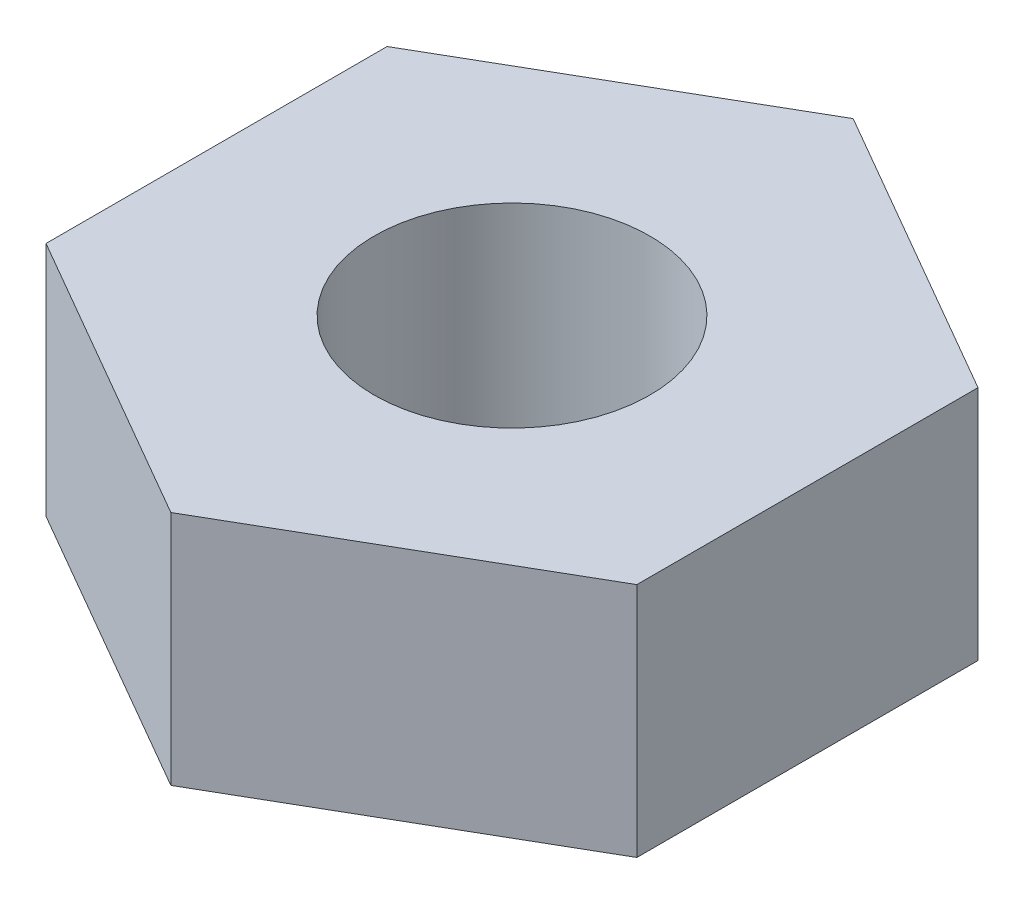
from build123d import *

# Parameters (mm, degrees)
ESQUISSE1_R      = 0.7
EXTRUSION1_DEPTH = 1.2


with BuildPart() as part:
    # Esquisse1 → Extrusion1 (new body)
    with BuildSketch(Plane(origin=(0, 0, 0), x_dir=(1, 0, 0), z_dir=(0, 1, 0))):
        Polygon((-1.5, 0.866025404), (-1.5, -0.866025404), (0, -1.732050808), (1.5, -0.866025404), (1.5, 0.866025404), (0, 1.732050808), align=None)
        with Locations(Location((0, 0, 0), (0, 0, 270))):
            Circle(ESQUISSE1_R, mode=Mode.SUBTRACT)
    extrude(amount=EXTRUSION1_DEPTH)


solid = part.part
